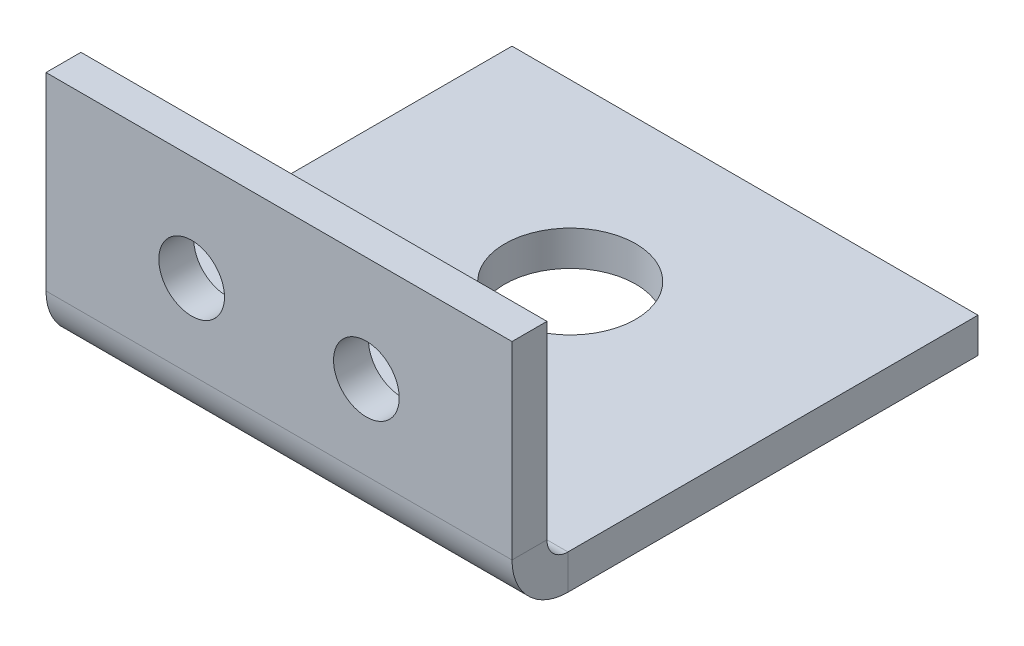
ISO-10303-21;
HEADER;
FILE_DESCRIPTION(('STEP AP214'),'2;1');
FILE_NAME('part.step','',(''),(''),'','','');
FILE_SCHEMA(('AUTOMOTIVE_DESIGN { 1 0 10303 214 1 1 1 1 }'));
ENDSEC;
DATA;
#1=APPLICATION_CONTEXT('core data for automotive mechanical design processes');
#2=APPLICATION_PROTOCOL_DEFINITION('international standard','automotive_design',2000,#1);
#3=PRODUCT_CONTEXT('',#1,'mechanical');
#4=PRODUCT('Part','Part','',(#3));
#5=PRODUCT_RELATED_PRODUCT_CATEGORY('part','',(#4));
#6=PRODUCT_DEFINITION_FORMATION('','',#4);
#7=PRODUCT_DEFINITION_CONTEXT('part definition',#1,'design');
#8=PRODUCT_DEFINITION('design','',#6,#7);
#9=PRODUCT_DEFINITION_SHAPE('','',#8);
#10=(LENGTH_UNIT() NAMED_UNIT(*) SI_UNIT(.MILLI.,.METRE.));
#11=(NAMED_UNIT(*) PLANE_ANGLE_UNIT() SI_UNIT($,.RADIAN.));
#12=(NAMED_UNIT(*) SI_UNIT($,.STERADIAN.) SOLID_ANGLE_UNIT());
#13=UNCERTAINTY_MEASURE_WITH_UNIT(LENGTH_MEASURE(1.E-05),#10,'distance_accuracy_value','');
#14=(GEOMETRIC_REPRESENTATION_CONTEXT(3) GLOBAL_UNCERTAINTY_ASSIGNED_CONTEXT((#13)) GLOBAL_UNIT_ASSIGNED_CONTEXT((#10,
#11,#12)) REPRESENTATION_CONTEXT('',''));
#15=CARTESIAN_POINT('',(0.,0.,0.));
#16=DIRECTION('',(0.,0.,1.));
#17=DIRECTION('',(1.,0.,0.));
#18=AXIS2_PLACEMENT_3D('',#15,#16,#17);
#19=CARTESIAN_POINT('',(12.7,3.048,0.));
#20=DIRECTION('',(1.,0.,0.));
#21=DIRECTION('',(0.,0.,-1.));
#22=AXIS2_PLACEMENT_3D('',#19,#20,#21);
#23=PLANE('',#22);
#24=DIRECTION('',(0.,0.,-1.));
#25=VECTOR('',#24,1.);
#26=CARTESIAN_POINT('',(12.7,3.048,0.));
#27=LINE('',#26,#25);
#28=CARTESIAN_POINT('',(12.7,3.048,0.));
#29=VERTEX_POINT('',#28);
#30=CARTESIAN_POINT('',(12.7,3.048,-1.905));
#31=VERTEX_POINT('',#30);
#32=EDGE_CURVE('E11',#29,#31,#27,.T.);
#33=ORIENTED_EDGE('',*,*,#32,.F.);
#34=CARTESIAN_POINT('',(12.7,3.048,-3.048));
#35=DIRECTION('',(-1.,0.,0.));
#36=DIRECTION('',(0.,0.,1.));
#37=AXIS2_PLACEMENT_3D('',#34,#35,#36);
#38=CIRCLE('',#37,3.048);
#39=CARTESIAN_POINT('',(12.7,0.,-3.048));
#40=VERTEX_POINT('',#39);
#41=EDGE_CURVE('E126',#29,#40,#38,.F.);
#42=ORIENTED_EDGE('',*,*,#41,.T.);
#43=DIRECTION('',(0.,-1.,0.));
#44=VECTOR('',#43,1.);
#45=CARTESIAN_POINT('',(12.7,1.905,-3.048));
#46=LINE('',#45,#44);
#47=CARTESIAN_POINT('',(12.7,1.905,-3.048));
#48=VERTEX_POINT('',#47);
#49=EDGE_CURVE('E44',#48,#40,#46,.T.);
#50=ORIENTED_EDGE('',*,*,#49,.F.);
#51=CARTESIAN_POINT('',(12.7,3.048,-3.048));
#52=DIRECTION('',(1.,0.,0.));
#53=DIRECTION('',(0.,0.,-1.));
#54=AXIS2_PLACEMENT_3D('',#51,#52,#53);
#55=CIRCLE('',#54,1.143);
#56=EDGE_CURVE('E133',#31,#48,#55,.T.);
#57=ORIENTED_EDGE('',*,*,#56,.F.);
#58=EDGE_LOOP('',(#33,#42,#50,#57));
#59=FACE_BOUND('',#58,.T.);
#60=ADVANCED_FACE('F36',(#59),#23,.T.);
#61=CARTESIAN_POINT('',(12.7,1.905,-3.048));
#62=DIRECTION('',(1.,0.,0.));
#63=DIRECTION('',(0.,0.,-1.));
#64=AXIS2_PLACEMENT_3D('',#61,#62,#63);
#65=PLANE('',#64);
#66=DIRECTION('',(0.,-1.,0.));
#67=VECTOR('',#66,1.);
#68=CARTESIAN_POINT('',(12.7,0.,0.));
#69=LINE('',#68,#67);
#70=CARTESIAN_POINT('',(12.7,13.3604,0.));
#71=VERTEX_POINT('',#70);
#72=EDGE_CURVE('E121',#71,#29,#69,.T.);
#73=ORIENTED_EDGE('',*,*,#72,.T.);
#74=ORIENTED_EDGE('',*,*,#32,.T.);
#75=DIRECTION('',(0.,1.,0.));
#76=VECTOR('',#75,1.);
#77=CARTESIAN_POINT('',(12.7,0.,-1.905));
#78=LINE('',#77,#76);
#79=CARTESIAN_POINT('',(12.7,13.3604,-1.905));
#80=VERTEX_POINT('',#79);
#81=EDGE_CURVE('E131',#80,#31,#78,.F.);
#82=ORIENTED_EDGE('',*,*,#81,.F.);
#83=DIRECTION('',(0.,0.,-1.));
#84=VECTOR('',#83,1.);
#85=CARTESIAN_POINT('',(12.7,13.3604,0.));
#86=LINE('',#85,#84);
#87=EDGE_CURVE('E112',#71,#80,#86,.T.);
#88=ORIENTED_EDGE('',*,*,#87,.F.);
#89=EDGE_LOOP('',(#73,#74,#82,#88));
#90=FACE_BOUND('',#89,.T.);
#91=ADVANCED_FACE('F129',(#90),#65,.T.);
#92=CARTESIAN_POINT('',(-12.7,0.,-3.048));
#93=DIRECTION('',(-1.,0.,0.));
#94=DIRECTION('',(0.,0.,1.));
#95=AXIS2_PLACEMENT_3D('',#92,#93,#94);
#96=PLANE('',#95);
#97=DIRECTION('',(0.,1.,0.));
#98=VECTOR('',#97,1.);
#99=CARTESIAN_POINT('',(-12.7,0.,-3.048));
#100=LINE('',#99,#98);
#101=CARTESIAN_POINT('',(-12.7,0.,-3.048));
#102=VERTEX_POINT('',#101);
#103=CARTESIAN_POINT('',(-12.7,1.905,-3.048));
#104=VERTEX_POINT('',#103);
#105=EDGE_CURVE('E87',#102,#104,#100,.T.);
#106=ORIENTED_EDGE('',*,*,#105,.F.);
#107=CARTESIAN_POINT('',(-12.7,3.048,-3.048));
#108=DIRECTION('',(-1.,0.,0.));
#109=DIRECTION('',(0.,0.,1.));
#110=AXIS2_PLACEMENT_3D('',#107,#108,#109);
#111=CIRCLE('',#110,3.048);
#112=CARTESIAN_POINT('',(-12.7,3.048,0.));
#113=VERTEX_POINT('',#112);
#114=EDGE_CURVE('E156',#113,#102,#111,.F.);
#115=ORIENTED_EDGE('',*,*,#114,.F.);
#116=DIRECTION('',(0.,0.,1.));
#117=VECTOR('',#116,1.);
#118=CARTESIAN_POINT('',(-12.7,3.048,-1.905));
#119=LINE('',#118,#117);
#120=CARTESIAN_POINT('',(-12.7,3.048,-1.905));
#121=VERTEX_POINT('',#120);
#122=EDGE_CURVE('E80',#121,#113,#119,.T.);
#123=ORIENTED_EDGE('',*,*,#122,.F.);
#124=CARTESIAN_POINT('',(-12.7,3.048,-3.048));
#125=DIRECTION('',(1.,0.,0.));
#126=DIRECTION('',(0.,0.,-1.));
#127=AXIS2_PLACEMENT_3D('',#124,#125,#126);
#128=CIRCLE('',#127,1.143);
#129=EDGE_CURVE('E149',#121,#104,#128,.T.);
#130=ORIENTED_EDGE('',*,*,#129,.T.);
#131=EDGE_LOOP('',(#106,#115,#123,#130));
#132=FACE_BOUND('',#131,.T.);
#133=ADVANCED_FACE('F188',(#132),#96,.T.);
#134=CARTESIAN_POINT('',(-12.7,3.048,-1.905));
#135=DIRECTION('',(-1.,0.,0.));
#136=DIRECTION('',(0.,0.,1.));
#137=AXIS2_PLACEMENT_3D('',#134,#135,#136);
#138=PLANE('',#137);
#139=DIRECTION('',(0.,0.,-1.));
#140=VECTOR('',#139,1.);
#141=CARTESIAN_POINT('',(-12.7,0.,0.));
#142=LINE('',#141,#140);
#143=CARTESIAN_POINT('',(-12.7,0.,-25.4));
#144=VERTEX_POINT('',#143);
#145=EDGE_CURVE('E139',#102,#144,#142,.T.);
#146=ORIENTED_EDGE('',*,*,#145,.F.);
#147=ORIENTED_EDGE('',*,*,#105,.T.);
#148=DIRECTION('',(0.,0.,-1.));
#149=VECTOR('',#148,1.);
#150=CARTESIAN_POINT('',(-12.7,1.905,0.));
#151=LINE('',#150,#149);
#152=CARTESIAN_POINT('',(-12.7,1.905,-25.4));
#153=VERTEX_POINT('',#152);
#154=EDGE_CURVE('E146',#104,#153,#151,.T.);
#155=ORIENTED_EDGE('',*,*,#154,.T.);
#156=DIRECTION('',(0.,-1.,0.));
#157=VECTOR('',#156,1.);
#158=CARTESIAN_POINT('',(-12.7,1.905,-25.4));
#159=LINE('',#158,#157);
#160=EDGE_CURVE('E142',#153,#144,#159,.T.);
#161=ORIENTED_EDGE('',*,*,#160,.T.);
#162=EDGE_LOOP('',(#146,#147,#155,#161));
#163=FACE_BOUND('',#162,.T.);
#164=ADVANCED_FACE('F175',(#163),#138,.T.);
#165=CARTESIAN_POINT('',(12.7,0.,0.));
#166=DIRECTION('',(0.,1.,0.));
#167=DIRECTION('',(0.,0.,1.));
#168=AXIS2_PLACEMENT_3D('',#165,#166,#167);
#169=PLANE('',#168);
#170=CARTESIAN_POINT('',(0.,0.,-15.875));
#171=DIRECTION('',(0.,-1.,0.));
#172=DIRECTION('',(0.,0.,-1.));
#173=AXIS2_PLACEMENT_3D('',#170,#171,#172);
#174=CIRCLE('',#173,3.5687);
#175=CARTESIAN_POINT('',(0.,0.,-19.4437));
#176=VERTEX_POINT('',#175);
#177=EDGE_CURVE('E200',#176,#176,#174,.T.);
#178=ORIENTED_EDGE('',*,*,#177,.F.);
#179=EDGE_LOOP('',(#178));
#180=FACE_BOUND('',#179,.T.);
#181=ORIENTED_EDGE('',*,*,#145,.T.);
#182=DIRECTION('',(-1.,0.,0.));
#183=VECTOR('',#182,1.);
#184=CARTESIAN_POINT('',(12.7,0.,-25.4));
#185=LINE('',#184,#183);
#186=CARTESIAN_POINT('',(12.7,0.,-25.4));
#187=VERTEX_POINT('',#186);
#188=EDGE_CURVE('E170',#187,#144,#185,.T.);
#189=ORIENTED_EDGE('',*,*,#188,.F.);
#190=DIRECTION('',(0.,0.,-1.));
#191=VECTOR('',#190,1.);
#192=CARTESIAN_POINT('',(12.7,0.,0.));
#193=LINE('',#192,#191);
#194=EDGE_CURVE('E93',#40,#187,#193,.T.);
#195=ORIENTED_EDGE('',*,*,#194,.F.);
#196=DIRECTION('',(-1.,0.,0.));
#197=VECTOR('',#196,1.);
#198=CARTESIAN_POINT('',(12.7,0.,-3.048));
#199=LINE('',#198,#197);
#200=EDGE_CURVE('E138',#40,#102,#199,.T.);
#201=ORIENTED_EDGE('',*,*,#200,.T.);
#202=EDGE_LOOP('',(#181,#189,#195,#201));
#203=FACE_BOUND('',#202,.T.);
#204=ADVANCED_FACE('F255',(#180,#203),#169,.F.);
#205=CARTESIAN_POINT('',(12.7,1.905,-25.4));
#206=DIRECTION('',(0.,0.,-1.));
#207=DIRECTION('',(0.,1.,0.));
#208=AXIS2_PLACEMENT_3D('',#205,#206,#207);
#209=PLANE('',#208);
#210=ORIENTED_EDGE('',*,*,#160,.F.);
#211=DIRECTION('',(-1.,0.,0.));
#212=VECTOR('',#211,1.);
#213=CARTESIAN_POINT('',(12.7,1.905,-25.4));
#214=LINE('',#213,#212);
#215=CARTESIAN_POINT('',(12.7,1.905,-25.4));
#216=VERTEX_POINT('',#215);
#217=EDGE_CURVE('E168',#216,#153,#214,.T.);
#218=ORIENTED_EDGE('',*,*,#217,.F.);
#219=DIRECTION('',(0.,-1.,0.));
#220=VECTOR('',#219,1.);
#221=CARTESIAN_POINT('',(12.7,1.905,-25.4));
#222=LINE('',#221,#220);
#223=EDGE_CURVE('E194',#216,#187,#222,.T.);
#224=ORIENTED_EDGE('',*,*,#223,.T.);
#225=ORIENTED_EDGE('',*,*,#188,.T.);
#226=EDGE_LOOP('',(#210,#218,#224,#225));
#227=FACE_BOUND('',#226,.T.);
#228=ADVANCED_FACE('F258',(#227),#209,.T.);
#229=CARTESIAN_POINT('',(12.7,1.905,0.));
#230=DIRECTION('',(0.,1.,0.));
#231=DIRECTION('',(0.,0.,1.));
#232=AXIS2_PLACEMENT_3D('',#229,#230,#231);
#233=PLANE('',#232);
#234=CARTESIAN_POINT('',(0.,1.905,-15.875));
#235=DIRECTION('',(0.,-1.,0.));
#236=DIRECTION('',(0.,0.,-1.));
#237=AXIS2_PLACEMENT_3D('',#234,#235,#236);
#238=CIRCLE('',#237,3.5687);
#239=CARTESIAN_POINT('',(0.,1.905,-19.4437));
#240=VERTEX_POINT('',#239);
#241=EDGE_CURVE('E143',#240,#240,#238,.T.);
#242=ORIENTED_EDGE('',*,*,#241,.T.);
#243=EDGE_LOOP('',(#242));
#244=FACE_BOUND('',#243,.T.);
#245=ORIENTED_EDGE('',*,*,#154,.F.);
#246=DIRECTION('',(-1.,0.,0.));
#247=VECTOR('',#246,1.);
#248=CARTESIAN_POINT('',(12.7,1.905,-3.048));
#249=LINE('',#248,#247);
#250=EDGE_CURVE('E165',#48,#104,#249,.T.);
#251=ORIENTED_EDGE('',*,*,#250,.F.);
#252=DIRECTION('',(0.,0.,-1.));
#253=VECTOR('',#252,1.);
#254=CARTESIAN_POINT('',(12.7,1.905,0.));
#255=LINE('',#254,#253);
#256=EDGE_CURVE('E193',#48,#216,#255,.T.);
#257=ORIENTED_EDGE('',*,*,#256,.T.);
#258=ORIENTED_EDGE('',*,*,#217,.T.);
#259=EDGE_LOOP('',(#245,#251,#257,#258));
#260=FACE_BOUND('',#259,.T.);
#261=ADVANCED_FACE('F186',(#244,#260),#233,.T.);
#262=CARTESIAN_POINT('',(12.7,3.048,-3.048));
#263=DIRECTION('',(-1.,0.,0.));
#264=DIRECTION('',(0.,0.,1.));
#265=AXIS2_PLACEMENT_3D('',#262,#263,#264);
#266=CYLINDRICAL_SURFACE('',#265,1.143);
#267=ORIENTED_EDGE('',*,*,#129,.F.);
#268=DIRECTION('',(-1.,0.,0.));
#269=VECTOR('',#268,1.);
#270=CARTESIAN_POINT('',(12.7,3.048,-1.905));
#271=LINE('',#270,#269);
#272=EDGE_CURVE('E162',#31,#121,#271,.T.);
#273=ORIENTED_EDGE('',*,*,#272,.F.);
#274=ORIENTED_EDGE('',*,*,#56,.T.);
#275=ORIENTED_EDGE('',*,*,#250,.T.);
#276=EDGE_LOOP('',(#267,#273,#274,#275));
#277=FACE_BOUND('',#276,.T.);
#278=ADVANCED_FACE('F181',(#277),#266,.F.);
#279=CARTESIAN_POINT('',(12.7,0.,-1.905));
#280=DIRECTION('',(0.,0.,-1.));
#281=DIRECTION('',(-1.,0.,0.));
#282=AXIS2_PLACEMENT_3D('',#279,#280,#281);
#283=PLANE('',#282);
#284=CARTESIAN_POINT('',(-4.7625,7.62,-1.905));
#285=DIRECTION('',(0.,0.,1.));
#286=DIRECTION('',(-1.,0.,0.));
#287=AXIS2_PLACEMENT_3D('',#284,#285,#286);
#288=CIRCLE('',#287,1.7907);
#289=CARTESIAN_POINT('',(-2.9718,7.62,-1.905));
#290=VERTEX_POINT('',#289);
#291=EDGE_CURVE('E209',#290,#290,#288,.T.);
#292=ORIENTED_EDGE('',*,*,#291,.T.);
#293=EDGE_LOOP('',(#292));
#294=FACE_BOUND('',#293,.T.);
#295=CARTESIAN_POINT('',(4.7625,7.62,-1.905));
#296=DIRECTION('',(0.,0.,1.));
#297=DIRECTION('',(1.,0.,0.));
#298=AXIS2_PLACEMENT_3D('',#295,#296,#297);
#299=CIRCLE('',#298,1.7907);
#300=CARTESIAN_POINT('',(6.5532,7.62,-1.905));
#301=VERTEX_POINT('',#300);
#302=EDGE_CURVE('E203',#301,#301,#299,.T.);
#303=ORIENTED_EDGE('',*,*,#302,.T.);
#304=EDGE_LOOP('',(#303));
#305=FACE_BOUND('',#304,.T.);
#306=DIRECTION('',(0.,1.,0.));
#307=VECTOR('',#306,1.);
#308=CARTESIAN_POINT('',(-12.7,0.,-1.905));
#309=LINE('',#308,#307);
#310=CARTESIAN_POINT('',(-12.7,13.3604,-1.905));
#311=VERTEX_POINT('',#310);
#312=EDGE_CURVE('E151',#311,#121,#309,.F.);
#313=ORIENTED_EDGE('',*,*,#312,.F.);
#314=DIRECTION('',(-1.,0.,0.));
#315=VECTOR('',#314,1.);
#316=CARTESIAN_POINT('',(12.7,13.3604,-1.905));
#317=LINE('',#316,#315);
#318=EDGE_CURVE('E116',#80,#311,#317,.T.);
#319=ORIENTED_EDGE('',*,*,#318,.F.);
#320=ORIENTED_EDGE('',*,*,#81,.T.);
#321=ORIENTED_EDGE('',*,*,#272,.T.);
#322=EDGE_LOOP('',(#313,#319,#320,#321));
#323=FACE_BOUND('',#322,.T.);
#324=ADVANCED_FACE('F191',(#294,#305,#323),#283,.T.);
#325=CARTESIAN_POINT('',(12.7,13.3604,0.));
#326=DIRECTION('',(0.,1.,0.));
#327=DIRECTION('',(0.,0.,1.));
#328=AXIS2_PLACEMENT_3D('',#325,#326,#327);
#329=PLANE('',#328);
#330=DIRECTION('',(0.,0.,-1.));
#331=VECTOR('',#330,1.);
#332=CARTESIAN_POINT('',(-12.7,13.3604,0.));
#333=LINE('',#332,#331);
#334=CARTESIAN_POINT('',(-12.7,13.3604,0.));
#335=VERTEX_POINT('',#334);
#336=EDGE_CURVE('E114',#335,#311,#333,.T.);
#337=ORIENTED_EDGE('',*,*,#336,.F.);
#338=DIRECTION('',(-1.,0.,0.));
#339=VECTOR('',#338,1.);
#340=CARTESIAN_POINT('',(12.7,13.3604,0.));
#341=LINE('',#340,#339);
#342=EDGE_CURVE('E108',#71,#335,#341,.T.);
#343=ORIENTED_EDGE('',*,*,#342,.F.);
#344=ORIENTED_EDGE('',*,*,#87,.T.);
#345=ORIENTED_EDGE('',*,*,#318,.T.);
#346=EDGE_LOOP('',(#337,#343,#344,#345));
#347=FACE_BOUND('',#346,.T.);
#348=ADVANCED_FACE('F110',(#347),#329,.T.);
#349=CARTESIAN_POINT('',(12.7,0.,0.));
#350=DIRECTION('',(0.,0.,-1.));
#351=DIRECTION('',(-1.,0.,0.));
#352=AXIS2_PLACEMENT_3D('',#349,#350,#351);
#353=PLANE('',#352);
#354=CARTESIAN_POINT('',(-4.7625,7.62,0.));
#355=DIRECTION('',(0.,0.,1.));
#356=DIRECTION('',(-1.,0.,0.));
#357=AXIS2_PLACEMENT_3D('',#354,#355,#356);
#358=CIRCLE('',#357,1.7907);
#359=CARTESIAN_POINT('',(-2.9718,7.62,0.));
#360=VERTEX_POINT('',#359);
#361=EDGE_CURVE('E212',#360,#360,#358,.T.);
#362=ORIENTED_EDGE('',*,*,#361,.F.);
#363=EDGE_LOOP('',(#362));
#364=FACE_BOUND('',#363,.T.);
#365=CARTESIAN_POINT('',(4.7625,7.62,0.));
#366=DIRECTION('',(0.,0.,1.));
#367=DIRECTION('',(1.,0.,0.));
#368=AXIS2_PLACEMENT_3D('',#365,#366,#367);
#369=CIRCLE('',#368,1.7907);
#370=CARTESIAN_POINT('',(6.5532,7.62,0.));
#371=VERTEX_POINT('',#370);
#372=EDGE_CURVE('E206',#371,#371,#369,.T.);
#373=ORIENTED_EDGE('',*,*,#372,.F.);
#374=EDGE_LOOP('',(#373));
#375=FACE_BOUND('',#374,.T.);
#376=DIRECTION('',(0.,-1.,0.));
#377=VECTOR('',#376,1.);
#378=CARTESIAN_POINT('',(-12.7,0.,0.));
#379=LINE('',#378,#377);
#380=EDGE_CURVE('E154',#335,#113,#379,.T.);
#381=ORIENTED_EDGE('',*,*,#380,.T.);
#382=DIRECTION('',(-1.,0.,0.));
#383=VECTOR('',#382,1.);
#384=CARTESIAN_POINT('',(12.7,3.048,0.));
#385=LINE('',#384,#383);
#386=EDGE_CURVE('E117',#29,#113,#385,.T.);
#387=ORIENTED_EDGE('',*,*,#386,.F.);
#388=ORIENTED_EDGE('',*,*,#72,.F.);
#389=ORIENTED_EDGE('',*,*,#342,.T.);
#390=EDGE_LOOP('',(#381,#387,#388,#389));
#391=FACE_BOUND('',#390,.T.);
#392=ADVANCED_FACE('F122',(#364,#375,#391),#353,.F.);
#393=CARTESIAN_POINT('',(12.7,3.048,-3.048));
#394=DIRECTION('',(-1.,0.,0.));
#395=DIRECTION('',(0.,0.,1.));
#396=AXIS2_PLACEMENT_3D('',#393,#394,#395);
#397=CYLINDRICAL_SURFACE('',#396,3.048);
#398=ORIENTED_EDGE('',*,*,#114,.T.);
#399=ORIENTED_EDGE('',*,*,#200,.F.);
#400=ORIENTED_EDGE('',*,*,#41,.F.);
#401=ORIENTED_EDGE('',*,*,#386,.T.);
#402=EDGE_LOOP('',(#398,#399,#400,#401));
#403=FACE_BOUND('',#402,.T.);
#404=ADVANCED_FACE('F229',(#403),#397,.T.);
#405=CARTESIAN_POINT('',(12.7,3.048,-3.048));
#406=DIRECTION('',(1.,0.,0.));
#407=DIRECTION('',(0.,0.,-1.));
#408=AXIS2_PLACEMENT_3D('',#405,#406,#407);
#409=PLANE('',#408);
#410=ORIENTED_EDGE('',*,*,#194,.T.);
#411=ORIENTED_EDGE('',*,*,#223,.F.);
#412=ORIENTED_EDGE('',*,*,#256,.F.);
#413=ORIENTED_EDGE('',*,*,#49,.T.);
#414=EDGE_LOOP('',(#410,#411,#412,#413));
#415=FACE_BOUND('',#414,.T.);
#416=ADVANCED_FACE('F274',(#415),#409,.T.);
#417=CARTESIAN_POINT('',(-12.7,3.048,-3.048));
#418=DIRECTION('',(1.,0.,0.));
#419=DIRECTION('',(0.,0.,-1.));
#420=AXIS2_PLACEMENT_3D('',#417,#418,#419);
#421=PLANE('',#420);
#422=ORIENTED_EDGE('',*,*,#312,.T.);
#423=ORIENTED_EDGE('',*,*,#122,.T.);
#424=ORIENTED_EDGE('',*,*,#380,.F.);
#425=ORIENTED_EDGE('',*,*,#336,.T.);
#426=EDGE_LOOP('',(#422,#423,#424,#425));
#427=FACE_BOUND('',#426,.T.);
#428=ADVANCED_FACE('F240',(#427),#421,.F.);
#429=CARTESIAN_POINT('',(0.,1.905,-15.875));
#430=DIRECTION('',(0.,-1.,0.));
#431=DIRECTION('',(0.,0.,-1.));
#432=AXIS2_PLACEMENT_3D('',#429,#430,#431);
#433=CYLINDRICAL_SURFACE('',#432,3.5687);
#434=CARTESIAN_POINT('',(0.,1.905,-19.4437));
#435=CARTESIAN_POINT('',(0.,1.88515625,-19.4437));
#436=CARTESIAN_POINT('',(0.,1.8653125,-19.4437));
#437=CARTESIAN_POINT('',(0.,1.825625,-19.4437));
#438=CARTESIAN_POINT('',(0.,1.80578125,-19.4437));
#439=CARTESIAN_POINT('',(0.,1.76609375,-19.4437));
#440=CARTESIAN_POINT('',(0.,1.74625,-19.4437));
#441=CARTESIAN_POINT('',(0.,1.7065625,-19.4437));
#442=CARTESIAN_POINT('',(0.,1.68671875,-19.4437));
#443=CARTESIAN_POINT('',(0.,1.64703125,-19.4437));
#444=CARTESIAN_POINT('',(0.,1.6271875,-19.4437));
#445=CARTESIAN_POINT('',(0.,1.5875,-19.4437));
#446=CARTESIAN_POINT('',(0.,1.56765625,-19.4437));
#447=CARTESIAN_POINT('',(0.,1.52796875,-19.4437));
#448=CARTESIAN_POINT('',(0.,1.508125,-19.4437));
#449=CARTESIAN_POINT('',(0.,1.4684375,-19.4437));
#450=CARTESIAN_POINT('',(0.,1.44859375,-19.4437));
#451=CARTESIAN_POINT('',(0.,1.40890625,-19.4437));
#452=CARTESIAN_POINT('',(0.,1.3890625,-19.4437));
#453=CARTESIAN_POINT('',(0.,1.349375,-19.4437));
#454=CARTESIAN_POINT('',(0.,1.32953125,-19.4437));
#455=CARTESIAN_POINT('',(0.,1.28984375,-19.4437));
#456=CARTESIAN_POINT('',(0.,1.27,-19.4437));
#457=CARTESIAN_POINT('',(0.,1.2303125,-19.4437));
#458=CARTESIAN_POINT('',(0.,1.21046875,-19.4437));
#459=CARTESIAN_POINT('',(0.,1.17078125,-19.4437));
#460=CARTESIAN_POINT('',(0.,1.1509375,-19.4437));
#461=CARTESIAN_POINT('',(0.,1.11125,-19.4437));
#462=CARTESIAN_POINT('',(0.,1.09140625,-19.4437));
#463=CARTESIAN_POINT('',(0.,1.05171875,-19.4437));
#464=CARTESIAN_POINT('',(0.,1.031875,-19.4437));
#465=CARTESIAN_POINT('',(0.,0.9921875,-19.4437));
#466=CARTESIAN_POINT('',(0.,0.97234375,-19.4437));
#467=CARTESIAN_POINT('',(0.,0.93265625,-19.4437));
#468=CARTESIAN_POINT('',(0.,0.9128125,-19.4437));
#469=CARTESIAN_POINT('',(0.,0.873125,-19.4437));
#470=CARTESIAN_POINT('',(0.,0.85328125,-19.4437));
#471=CARTESIAN_POINT('',(0.,0.81359375,-19.4437));
#472=CARTESIAN_POINT('',(0.,0.79375,-19.4437));
#473=CARTESIAN_POINT('',(0.,0.7540625,-19.4437));
#474=CARTESIAN_POINT('',(0.,0.73421875,-19.4437));
#475=CARTESIAN_POINT('',(0.,0.69453125,-19.4437));
#476=CARTESIAN_POINT('',(0.,0.6746875,-19.4437));
#477=CARTESIAN_POINT('',(0.,0.635,-19.4437));
#478=CARTESIAN_POINT('',(0.,0.61515625,-19.4437));
#479=CARTESIAN_POINT('',(0.,0.57546875,-19.4437));
#480=CARTESIAN_POINT('',(0.,0.555625,-19.4437));
#481=CARTESIAN_POINT('',(0.,0.5159375,-19.4437));
#482=CARTESIAN_POINT('',(0.,0.49609375,-19.4437));
#483=CARTESIAN_POINT('',(0.,0.45640625,-19.4437));
#484=CARTESIAN_POINT('',(0.,0.4365625,-19.4437));
#485=CARTESIAN_POINT('',(0.,0.396875,-19.4437));
#486=CARTESIAN_POINT('',(0.,0.37703125,-19.4437));
#487=CARTESIAN_POINT('',(0.,0.33734375,-19.4437));
#488=CARTESIAN_POINT('',(0.,0.3175,-19.4437));
#489=CARTESIAN_POINT('',(0.,0.2778125,-19.4437));
#490=CARTESIAN_POINT('',(0.,0.25796875,-19.4437));
#491=CARTESIAN_POINT('',(0.,0.21828125,-19.4437));
#492=CARTESIAN_POINT('',(0.,0.1984375,-19.4437));
#493=CARTESIAN_POINT('',(0.,0.15875,-19.4437));
#494=CARTESIAN_POINT('',(0.,0.13890625,-19.4437));
#495=CARTESIAN_POINT('',(0.,0.09921875,-19.4437));
#496=CARTESIAN_POINT('',(0.,0.0793749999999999,-19.4437));
#497=CARTESIAN_POINT('',(0.,0.0396874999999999,-19.4437));
#498=CARTESIAN_POINT('',(0.,0.01984375,-19.4437));
#499=CARTESIAN_POINT('',(0.,0.,-19.4437));
#500=B_SPLINE_CURVE_WITH_KNOTS('',3,(#434,#435,#436,#437,#438,#439,#440,#441,#442,#443,#444,
#445,#446,#447,#448,#449,#450,#451,#452,#453,#454,#455,#456,#457,#458,#459,#460,#461,#462,#463,
#464,#465,#466,#467,#468,#469,#470,#471,#472,#473,#474,#475,#476,#477,#478,#479,#480,#481,#482,
#483,#484,#485,#486,#487,#488,#489,#490,#491,#492,#493,#494,#495,#496,#497,#498,#499),
.UNSPECIFIED.,.F.,.F.,(4,2,2,2,2,2,2,2,2,2,2,2,2,2,2,2,2,2,2,2,2,2,2,2,2,2,2,2,2,2,2,2,4),(0.,
0.0595312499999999,0.1190625,0.17859375,0.238125,0.29765625,0.3571875,0.41671875,0.47625,
0.53578125,0.5953125,0.65484375,0.714375,0.77390625,0.8334375,0.89296875,0.9525,1.01203125,
1.0715625,1.13109375,1.190625,1.25015625,1.3096875,1.36921875,1.42875,1.48828125,1.5478125,
1.60734375,1.666875,1.72640625,1.7859375,1.84546875,1.905),.UNSPECIFIED.);
#501=EDGE_CURVE('BSEAM234',#240,#176,#500,.T.);
#502=ORIENTED_EDGE('',*,*,#241,.F.);
#503=ORIENTED_EDGE('',*,*,#177,.T.);
#504=ORIENTED_EDGE('',*,*,#501,.T.);
#505=ORIENTED_EDGE('',*,*,#501,.F.);
#506=EDGE_LOOP('',(#502,#504,#503,#505));
#507=FACE_BOUND('',#506,.T.);
#508=ADVANCED_FACE('F234',(#507),#433,.F.);
#509=CARTESIAN_POINT('',(4.7625,7.62,-1.905));
#510=DIRECTION('',(0.,0.,1.));
#511=DIRECTION('',(1.,0.,0.));
#512=AXIS2_PLACEMENT_3D('',#509,#510,#511);
#513=CYLINDRICAL_SURFACE('',#512,1.7907);
#514=CARTESIAN_POINT('',(6.5532,7.62,-1.905));
#515=CARTESIAN_POINT('',(6.5532,7.62,-1.88515625));
#516=CARTESIAN_POINT('',(6.5532,7.62,-1.8653125));
#517=CARTESIAN_POINT('',(6.5532,7.62,-1.825625));
#518=CARTESIAN_POINT('',(6.5532,7.62,-1.80578125));
#519=CARTESIAN_POINT('',(6.5532,7.62,-1.76609375));
#520=CARTESIAN_POINT('',(6.5532,7.62,-1.74625));
#521=CARTESIAN_POINT('',(6.5532,7.62,-1.7065625));
#522=CARTESIAN_POINT('',(6.5532,7.62,-1.68671875));
#523=CARTESIAN_POINT('',(6.5532,7.62,-1.64703125));
#524=CARTESIAN_POINT('',(6.5532,7.62,-1.6271875));
#525=CARTESIAN_POINT('',(6.5532,7.62,-1.5875));
#526=CARTESIAN_POINT('',(6.5532,7.62,-1.56765625));
#527=CARTESIAN_POINT('',(6.5532,7.62,-1.52796875));
#528=CARTESIAN_POINT('',(6.5532,7.62,-1.508125));
#529=CARTESIAN_POINT('',(6.5532,7.62,-1.4684375));
#530=CARTESIAN_POINT('',(6.5532,7.62,-1.44859375));
#531=CARTESIAN_POINT('',(6.5532,7.62,-1.40890625));
#532=CARTESIAN_POINT('',(6.5532,7.62,-1.3890625));
#533=CARTESIAN_POINT('',(6.5532,7.62,-1.349375));
#534=CARTESIAN_POINT('',(6.5532,7.62,-1.32953125));
#535=CARTESIAN_POINT('',(6.5532,7.62,-1.28984375));
#536=CARTESIAN_POINT('',(6.5532,7.62,-1.27));
#537=CARTESIAN_POINT('',(6.5532,7.62,-1.2303125));
#538=CARTESIAN_POINT('',(6.5532,7.62,-1.21046875));
#539=CARTESIAN_POINT('',(6.5532,7.62,-1.17078125));
#540=CARTESIAN_POINT('',(6.5532,7.62,-1.1509375));
#541=CARTESIAN_POINT('',(6.5532,7.62,-1.11125));
#542=CARTESIAN_POINT('',(6.5532,7.62,-1.09140625));
#543=CARTESIAN_POINT('',(6.5532,7.62,-1.05171875));
#544=CARTESIAN_POINT('',(6.5532,7.62,-1.031875));
#545=CARTESIAN_POINT('',(6.5532,7.62,-0.9921875));
#546=CARTESIAN_POINT('',(6.5532,7.62,-0.97234375));
#547=CARTESIAN_POINT('',(6.5532,7.62,-0.93265625));
#548=CARTESIAN_POINT('',(6.5532,7.62,-0.9128125));
#549=CARTESIAN_POINT('',(6.5532,7.62,-0.873125));
#550=CARTESIAN_POINT('',(6.5532,7.62,-0.85328125));
#551=CARTESIAN_POINT('',(6.5532,7.62,-0.81359375));
#552=CARTESIAN_POINT('',(6.5532,7.62,-0.79375));
#553=CARTESIAN_POINT('',(6.5532,7.62,-0.7540625));
#554=CARTESIAN_POINT('',(6.5532,7.62,-0.73421875));
#555=CARTESIAN_POINT('',(6.5532,7.62,-0.69453125));
#556=CARTESIAN_POINT('',(6.5532,7.62,-0.6746875));
#557=CARTESIAN_POINT('',(6.5532,7.62,-0.635));
#558=CARTESIAN_POINT('',(6.5532,7.62,-0.61515625));
#559=CARTESIAN_POINT('',(6.5532,7.62,-0.57546875));
#560=CARTESIAN_POINT('',(6.5532,7.62,-0.555625));
#561=CARTESIAN_POINT('',(6.5532,7.62,-0.5159375));
#562=CARTESIAN_POINT('',(6.5532,7.62,-0.49609375));
#563=CARTESIAN_POINT('',(6.5532,7.62,-0.45640625));
#564=CARTESIAN_POINT('',(6.5532,7.62,-0.4365625));
#565=CARTESIAN_POINT('',(6.5532,7.62,-0.396875));
#566=CARTESIAN_POINT('',(6.5532,7.62,-0.37703125));
#567=CARTESIAN_POINT('',(6.5532,7.62,-0.33734375));
#568=CARTESIAN_POINT('',(6.5532,7.62,-0.3175));
#569=CARTESIAN_POINT('',(6.5532,7.62,-0.2778125));
#570=CARTESIAN_POINT('',(6.5532,7.62,-0.25796875));
#571=CARTESIAN_POINT('',(6.5532,7.62,-0.21828125));
#572=CARTESIAN_POINT('',(6.5532,7.62,-0.1984375));
#573=CARTESIAN_POINT('',(6.5532,7.62,-0.15875));
#574=CARTESIAN_POINT('',(6.5532,7.62,-0.13890625));
#575=CARTESIAN_POINT('',(6.5532,7.62,-0.09921875));
#576=CARTESIAN_POINT('',(6.5532,7.62,-0.0793749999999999));
#577=CARTESIAN_POINT('',(6.5532,7.62,-0.0396874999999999));
#578=CARTESIAN_POINT('',(6.5532,7.62,-0.01984375));
#579=CARTESIAN_POINT('',(6.5532,7.62,0.));
#580=B_SPLINE_CURVE_WITH_KNOTS('',3,(#514,#515,#516,#517,#518,#519,#520,#521,#522,#523,#524,
#525,#526,#527,#528,#529,#530,#531,#532,#533,#534,#535,#536,#537,#538,#539,#540,#541,#542,#543,
#544,#545,#546,#547,#548,#549,#550,#551,#552,#553,#554,#555,#556,#557,#558,#559,#560,#561,#562,
#563,#564,#565,#566,#567,#568,#569,#570,#571,#572,#573,#574,#575,#576,#577,#578,#579),
.UNSPECIFIED.,.F.,.F.,(4,2,2,2,2,2,2,2,2,2,2,2,2,2,2,2,2,2,2,2,2,2,2,2,2,2,2,2,2,2,2,2,4),(0.,
0.0595312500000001,0.1190625,0.17859375,0.238125,0.29765625,0.3571875,0.41671875,0.47625,
0.53578125,0.5953125,0.65484375,0.714375,0.77390625,0.8334375,0.89296875,0.9525,1.01203125,
1.0715625,1.13109375,1.190625,1.25015625,1.3096875,1.36921875,1.42875,1.48828125,1.5478125,
1.60734375,1.666875,1.72640625,1.7859375,1.84546875,1.905),.UNSPECIFIED.);
#581=EDGE_CURVE('BSEAM223',#301,#371,#580,.T.);
#582=ORIENTED_EDGE('',*,*,#302,.F.);
#583=ORIENTED_EDGE('',*,*,#372,.T.);
#584=ORIENTED_EDGE('',*,*,#581,.T.);
#585=ORIENTED_EDGE('',*,*,#581,.F.);
#586=EDGE_LOOP('',(#582,#584,#583,#585));
#587=FACE_BOUND('',#586,.T.);
#588=ADVANCED_FACE('F223',(#587),#513,.F.);
#589=CARTESIAN_POINT('',(-4.7625,7.62,-1.905));
#590=DIRECTION('',(0.,0.,1.));
#591=DIRECTION('',(1.,0.,0.));
#592=AXIS2_PLACEMENT_3D('',#589,#590,#591);
#593=CYLINDRICAL_SURFACE('',#592,1.7907);
#594=CARTESIAN_POINT('',(-2.9718,7.62,-1.905));
#595=CARTESIAN_POINT('',(-2.9718,7.62,-1.88515625));
#596=CARTESIAN_POINT('',(-2.9718,7.62,-1.8653125));
#597=CARTESIAN_POINT('',(-2.9718,7.62,-1.825625));
#598=CARTESIAN_POINT('',(-2.9718,7.62,-1.80578125));
#599=CARTESIAN_POINT('',(-2.9718,7.62,-1.76609375));
#600=CARTESIAN_POINT('',(-2.9718,7.62,-1.74625));
#601=CARTESIAN_POINT('',(-2.9718,7.62,-1.7065625));
#602=CARTESIAN_POINT('',(-2.9718,7.62,-1.68671875));
#603=CARTESIAN_POINT('',(-2.9718,7.62,-1.64703125));
#604=CARTESIAN_POINT('',(-2.9718,7.62,-1.6271875));
#605=CARTESIAN_POINT('',(-2.9718,7.62,-1.5875));
#606=CARTESIAN_POINT('',(-2.9718,7.62,-1.56765625));
#607=CARTESIAN_POINT('',(-2.9718,7.62,-1.52796875));
#608=CARTESIAN_POINT('',(-2.9718,7.62,-1.508125));
#609=CARTESIAN_POINT('',(-2.9718,7.62,-1.4684375));
#610=CARTESIAN_POINT('',(-2.9718,7.62,-1.44859375));
#611=CARTESIAN_POINT('',(-2.9718,7.62,-1.40890625));
#612=CARTESIAN_POINT('',(-2.9718,7.62,-1.3890625));
#613=CARTESIAN_POINT('',(-2.9718,7.62,-1.349375));
#614=CARTESIAN_POINT('',(-2.9718,7.62,-1.32953125));
#615=CARTESIAN_POINT('',(-2.9718,7.62,-1.28984375));
#616=CARTESIAN_POINT('',(-2.9718,7.62,-1.27));
#617=CARTESIAN_POINT('',(-2.9718,7.62,-1.2303125));
#618=CARTESIAN_POINT('',(-2.9718,7.62,-1.21046875));
#619=CARTESIAN_POINT('',(-2.9718,7.62,-1.17078125));
#620=CARTESIAN_POINT('',(-2.9718,7.62,-1.1509375));
#621=CARTESIAN_POINT('',(-2.9718,7.62,-1.11125));
#622=CARTESIAN_POINT('',(-2.9718,7.62,-1.09140625));
#623=CARTESIAN_POINT('',(-2.9718,7.62,-1.05171875));
#624=CARTESIAN_POINT('',(-2.9718,7.62,-1.031875));
#625=CARTESIAN_POINT('',(-2.9718,7.62,-0.9921875));
#626=CARTESIAN_POINT('',(-2.9718,7.62,-0.97234375));
#627=CARTESIAN_POINT('',(-2.9718,7.62,-0.93265625));
#628=CARTESIAN_POINT('',(-2.9718,7.62,-0.9128125));
#629=CARTESIAN_POINT('',(-2.9718,7.62,-0.873125));
#630=CARTESIAN_POINT('',(-2.9718,7.62,-0.85328125));
#631=CARTESIAN_POINT('',(-2.9718,7.62,-0.81359375));
#632=CARTESIAN_POINT('',(-2.9718,7.62,-0.79375));
#633=CARTESIAN_POINT('',(-2.9718,7.62,-0.7540625));
#634=CARTESIAN_POINT('',(-2.9718,7.62,-0.73421875));
#635=CARTESIAN_POINT('',(-2.9718,7.62,-0.69453125));
#636=CARTESIAN_POINT('',(-2.9718,7.62,-0.6746875));
#637=CARTESIAN_POINT('',(-2.9718,7.62,-0.635));
#638=CARTESIAN_POINT('',(-2.9718,7.62,-0.61515625));
#639=CARTESIAN_POINT('',(-2.9718,7.62,-0.57546875));
#640=CARTESIAN_POINT('',(-2.9718,7.62,-0.555625));
#641=CARTESIAN_POINT('',(-2.9718,7.62,-0.5159375));
#642=CARTESIAN_POINT('',(-2.9718,7.62,-0.49609375));
#643=CARTESIAN_POINT('',(-2.9718,7.62,-0.45640625));
#644=CARTESIAN_POINT('',(-2.9718,7.62,-0.4365625));
#645=CARTESIAN_POINT('',(-2.9718,7.62,-0.396875));
#646=CARTESIAN_POINT('',(-2.9718,7.62,-0.37703125));
#647=CARTESIAN_POINT('',(-2.9718,7.62,-0.33734375));
#648=CARTESIAN_POINT('',(-2.9718,7.62,-0.3175));
#649=CARTESIAN_POINT('',(-2.9718,7.62,-0.2778125));
#650=CARTESIAN_POINT('',(-2.9718,7.62,-0.25796875));
#651=CARTESIAN_POINT('',(-2.9718,7.62,-0.21828125));
#652=CARTESIAN_POINT('',(-2.9718,7.62,-0.1984375));
#653=CARTESIAN_POINT('',(-2.9718,7.62,-0.15875));
#654=CARTESIAN_POINT('',(-2.9718,7.62,-0.13890625));
#655=CARTESIAN_POINT('',(-2.9718,7.62,-0.09921875));
#656=CARTESIAN_POINT('',(-2.9718,7.62,-0.0793749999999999));
#657=CARTESIAN_POINT('',(-2.9718,7.62,-0.0396874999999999));
#658=CARTESIAN_POINT('',(-2.9718,7.62,-0.01984375));
#659=CARTESIAN_POINT('',(-2.9718,7.62,0.));
#660=B_SPLINE_CURVE_WITH_KNOTS('',3,(#594,#595,#596,#597,#598,#599,#600,#601,#602,#603,#604,
#605,#606,#607,#608,#609,#610,#611,#612,#613,#614,#615,#616,#617,#618,#619,#620,#621,#622,#623,
#624,#625,#626,#627,#628,#629,#630,#631,#632,#633,#634,#635,#636,#637,#638,#639,#640,#641,#642,
#643,#644,#645,#646,#647,#648,#649,#650,#651,#652,#653,#654,#655,#656,#657,#658,#659),
.UNSPECIFIED.,.F.,.F.,(4,2,2,2,2,2,2,2,2,2,2,2,2,2,2,2,2,2,2,2,2,2,2,2,2,2,2,2,2,2,2,2,4),(0.,
0.0595312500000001,0.1190625,0.17859375,0.238125,0.29765625,0.3571875,0.41671875,0.47625,
0.53578125,0.5953125,0.65484375,0.714375,0.77390625,0.8334375,0.89296875,0.9525,1.01203125,
1.0715625,1.13109375,1.190625,1.25015625,1.3096875,1.36921875,1.42875,1.48828125,1.5478125,
1.60734375,1.666875,1.72640625,1.7859375,1.84546875,1.905),.UNSPECIFIED.);
#661=EDGE_CURVE('BSEAM220',#290,#360,#660,.T.);
#662=ORIENTED_EDGE('',*,*,#291,.F.);
#663=ORIENTED_EDGE('',*,*,#361,.T.);
#664=ORIENTED_EDGE('',*,*,#661,.T.);
#665=ORIENTED_EDGE('',*,*,#661,.F.);
#666=EDGE_LOOP('',(#662,#664,#663,#665));
#667=FACE_BOUND('',#666,.T.);
#668=ADVANCED_FACE('F220',(#667),#593,.F.);
#669=CLOSED_SHELL('',(#60,#91,#133,#164,#204,#228,#261,#278,#324,#348,#392,#404,#416,#428,#508,
#588,#668));
#670=MANIFOLD_SOLID_BREP('B2',#669);
#671=ADVANCED_BREP_SHAPE_REPRESENTATION('',(#18,#670),#14);
#672=SHAPE_DEFINITION_REPRESENTATION(#9,#671);
ENDSEC;
END-ISO-10303-21;
